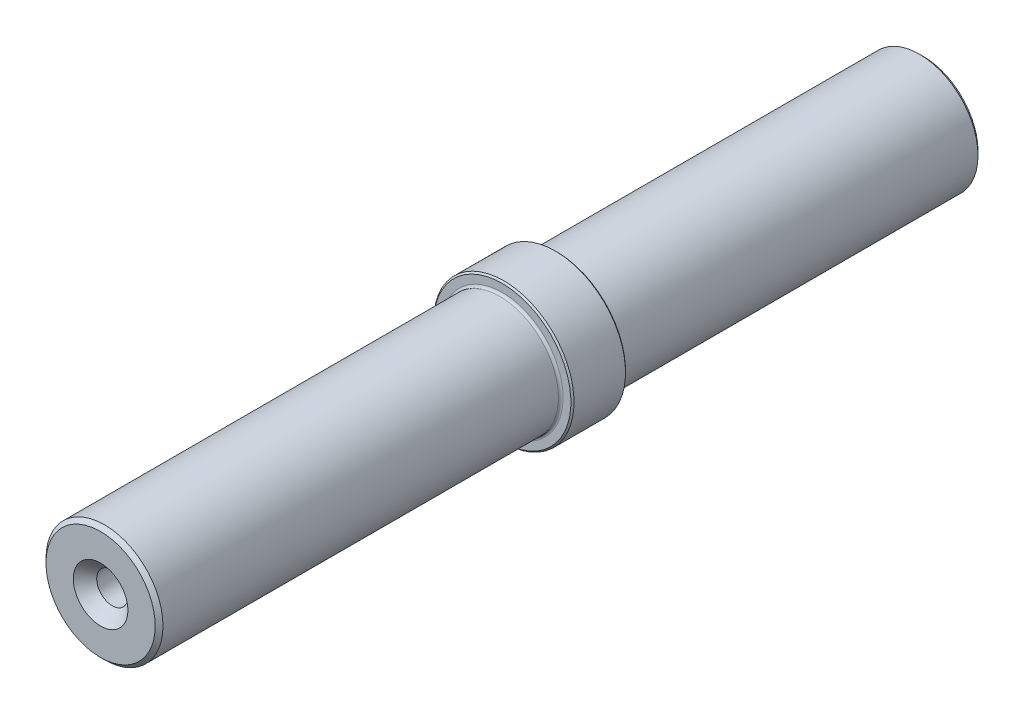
ISO-10303-21;
HEADER;
FILE_DESCRIPTION(('STEP AP214'),'2;1');
FILE_NAME('part.step','',(''),(''),'','','');
FILE_SCHEMA(('AUTOMOTIVE_DESIGN { 1 0 10303 214 1 1 1 1 }'));
ENDSEC;
DATA;
#1=APPLICATION_CONTEXT('core data for automotive mechanical design processes');
#2=APPLICATION_PROTOCOL_DEFINITION('international standard','automotive_design',2000,#1);
#3=PRODUCT_CONTEXT('',#1,'mechanical');
#4=PRODUCT('Part','Part','',(#3));
#5=PRODUCT_RELATED_PRODUCT_CATEGORY('part','',(#4));
#6=PRODUCT_DEFINITION_FORMATION('','',#4);
#7=PRODUCT_DEFINITION_CONTEXT('part definition',#1,'design');
#8=PRODUCT_DEFINITION('design','',#6,#7);
#9=PRODUCT_DEFINITION_SHAPE('','',#8);
#10=(LENGTH_UNIT() NAMED_UNIT(*) SI_UNIT(.MILLI.,.METRE.));
#11=(NAMED_UNIT(*) PLANE_ANGLE_UNIT() SI_UNIT($,.RADIAN.));
#12=(NAMED_UNIT(*) SI_UNIT($,.STERADIAN.) SOLID_ANGLE_UNIT());
#13=UNCERTAINTY_MEASURE_WITH_UNIT(LENGTH_MEASURE(1.E-05),#10,'distance_accuracy_value','');
#14=(GEOMETRIC_REPRESENTATION_CONTEXT(3) GLOBAL_UNCERTAINTY_ASSIGNED_CONTEXT((#13)) GLOBAL_UNIT_ASSIGNED_CONTEXT((#10,
#11,#12)) REPRESENTATION_CONTEXT('',''));
#15=CARTESIAN_POINT('',(0.,0.,0.));
#16=DIRECTION('',(0.,0.,1.));
#17=DIRECTION('',(1.,0.,0.));
#18=AXIS2_PLACEMENT_3D('',#15,#16,#17);
#19=CARTESIAN_POINT('',(0.,0.,105.5));
#20=DIRECTION('',(0.,0.,-1.));
#21=DIRECTION('',(-1.,0.,0.));
#22=AXIS2_PLACEMENT_3D('',#19,#20,#21);
#23=CYLINDRICAL_SURFACE('',#22,7.5);
#24=CARTESIAN_POINT('',(0.,0.,54.3));
#25=DIRECTION('',(0.,0.,-1.));
#26=DIRECTION('',(-1.,0.,0.));
#27=AXIS2_PLACEMENT_3D('',#24,#25,#26);
#28=CIRCLE('',#27,7.5);
#29=CARTESIAN_POINT('',(-7.5,0.,54.3));
#30=VERTEX_POINT('',#29);
#31=EDGE_CURVE('E112',#30,#30,#28,.F.);
#32=ORIENTED_EDGE('',*,*,#31,.T.);
#33=EDGE_LOOP('',(#32));
#34=FACE_BOUND('',#33,.T.);
#35=CARTESIAN_POINT('',(0.,0.,105.));
#36=DIRECTION('',(0.,0.,1.));
#37=DIRECTION('',(1.,0.,0.));
#38=AXIS2_PLACEMENT_3D('',#35,#36,#37);
#39=CIRCLE('',#38,7.5);
#40=CARTESIAN_POINT('',(7.5,0.,105.));
#41=VERTEX_POINT('',#40);
#42=EDGE_CURVE('E100',#41,#41,#39,.F.);
#43=ORIENTED_EDGE('',*,*,#42,.T.);
#44=EDGE_LOOP('',(#43));
#45=FACE_BOUND('',#44,.T.);
#46=ADVANCED_FACE('F57',(#34,#45),#23,.T.);
#47=CARTESIAN_POINT('',(0.,0.,105.5));
#48=DIRECTION('',(0.,0.,1.));
#49=DIRECTION('',(1.,0.,0.));
#50=AXIS2_PLACEMENT_3D('',#47,#48,#49);
#51=PLANE('',#50);
#52=CARTESIAN_POINT('',(0.,0.,105.5));
#53=DIRECTION('',(0.,0.,1.));
#54=DIRECTION('',(1.,0.,0.));
#55=AXIS2_PLACEMENT_3D('',#52,#53,#54);
#56=CIRCLE('',#55,6.99999999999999);
#57=CARTESIAN_POINT('',(6.99999999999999,0.,105.5));
#58=VERTEX_POINT('',#57);
#59=EDGE_CURVE('E97',#58,#58,#56,.T.);
#60=ORIENTED_EDGE('',*,*,#59,.T.);
#61=EDGE_LOOP('',(#60));
#62=FACE_BOUND('',#61,.T.);
#63=CARTESIAN_POINT('',(0.,0.,105.5));
#64=DIRECTION('',(0.,0.,1.));
#65=DIRECTION('',(1.,0.,0.));
#66=AXIS2_PLACEMENT_3D('',#63,#64,#65);
#67=CIRCLE('',#66,3.5);
#68=CARTESIAN_POINT('',(3.5,0.,105.5));
#69=VERTEX_POINT('',#68);
#70=EDGE_CURVE('E88',#69,#69,#67,.T.);
#71=ORIENTED_EDGE('',*,*,#70,.F.);
#72=EDGE_LOOP('',(#71));
#73=FACE_BOUND('',#72,.T.);
#74=ADVANCED_FACE('F175',(#62,#73),#51,.T.);
#75=CARTESIAN_POINT('',(0.,0.,54.));
#76=DIRECTION('',(0.,0.,-1.));
#77=DIRECTION('',(-1.,0.,0.));
#78=AXIS2_PLACEMENT_3D('',#75,#76,#77);
#79=CYLINDRICAL_SURFACE('',#78,9.);
#80=CARTESIAN_POINT('',(0.,0.,47.2));
#81=DIRECTION('',(0.,0.,-1.));
#82=DIRECTION('',(-1.,0.,0.));
#83=AXIS2_PLACEMENT_3D('',#80,#81,#82);
#84=CIRCLE('',#83,9.);
#85=CARTESIAN_POINT('',(-9.,0.,47.2));
#86=VERTEX_POINT('',#85);
#87=EDGE_CURVE('E65',#86,#86,#84,.F.);
#88=ORIENTED_EDGE('',*,*,#87,.T.);
#89=EDGE_LOOP('',(#88));
#90=FACE_BOUND('',#89,.T.);
#91=CARTESIAN_POINT('',(0.,0.,53.8));
#92=DIRECTION('',(0.,0.,-1.));
#93=DIRECTION('',(-1.,0.,0.));
#94=AXIS2_PLACEMENT_3D('',#91,#92,#93);
#95=CIRCLE('',#94,9.);
#96=CARTESIAN_POINT('',(-9.,0.,53.8));
#97=VERTEX_POINT('',#96);
#98=EDGE_CURVE('E124',#97,#97,#95,.T.);
#99=ORIENTED_EDGE('',*,*,#98,.T.);
#100=EDGE_LOOP('',(#99));
#101=FACE_BOUND('',#100,.T.);
#102=ADVANCED_FACE('F129',(#90,#101),#79,.T.);
#103=CARTESIAN_POINT('',(0.,0.,54.));
#104=DIRECTION('',(0.,0.,-1.));
#105=DIRECTION('',(-1.,0.,0.));
#106=AXIS2_PLACEMENT_3D('',#103,#104,#105);
#107=PLANE('',#106);
#108=CARTESIAN_POINT('',(0.,0.,54.));
#109=DIRECTION('',(0.,0.,-1.));
#110=DIRECTION('',(-1.,0.,0.));
#111=AXIS2_PLACEMENT_3D('',#108,#109,#110);
#112=CIRCLE('',#111,8.79999999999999);
#113=CARTESIAN_POINT('',(-8.79999999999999,0.,54.));
#114=VERTEX_POINT('',#113);
#115=EDGE_CURVE('E13',#114,#114,#112,.F.);
#116=ORIENTED_EDGE('',*,*,#115,.T.);
#117=EDGE_LOOP('',(#116));
#118=FACE_BOUND('',#117,.T.);
#119=CARTESIAN_POINT('',(0.,0.,54.));
#120=DIRECTION('',(0.,0.,-1.));
#121=DIRECTION('',(-1.,0.,0.));
#122=AXIS2_PLACEMENT_3D('',#119,#120,#121);
#123=CIRCLE('',#122,7.8);
#124=CARTESIAN_POINT('',(-7.8,0.,54.));
#125=VERTEX_POINT('',#124);
#126=EDGE_CURVE('E109',#125,#125,#123,.T.);
#127=ORIENTED_EDGE('',*,*,#126,.T.);
#128=EDGE_LOOP('',(#127));
#129=FACE_BOUND('',#128,.T.);
#130=ADVANCED_FACE('F142',(#118,#129),#107,.F.);
#131=CARTESIAN_POINT('',(0.,0.,47.));
#132=DIRECTION('',(0.,0.,-1.));
#133=DIRECTION('',(-1.,0.,0.));
#134=AXIS2_PLACEMENT_3D('',#131,#132,#133);
#135=PLANE('',#134);
#136=CARTESIAN_POINT('',(0.,0.,47.));
#137=DIRECTION('',(0.,0.,-1.));
#138=DIRECTION('',(-1.,0.,0.));
#139=AXIS2_PLACEMENT_3D('',#136,#137,#138);
#140=CIRCLE('',#139,8.8);
#141=CARTESIAN_POINT('',(-8.8,0.,47.));
#142=VERTEX_POINT('',#141);
#143=EDGE_CURVE('E121',#142,#142,#140,.T.);
#144=ORIENTED_EDGE('',*,*,#143,.T.);
#145=EDGE_LOOP('',(#144));
#146=FACE_BOUND('',#145,.T.);
#147=CARTESIAN_POINT('',(0.,0.,47.));
#148=DIRECTION('',(0.,0.,-1.));
#149=DIRECTION('',(-1.,0.,0.));
#150=AXIS2_PLACEMENT_3D('',#147,#148,#149);
#151=CIRCLE('',#150,7.8);
#152=CARTESIAN_POINT('',(-7.8,0.,47.));
#153=VERTEX_POINT('',#152);
#154=EDGE_CURVE('E118',#153,#153,#151,.F.);
#155=ORIENTED_EDGE('',*,*,#154,.T.);
#156=EDGE_LOOP('',(#155));
#157=FACE_BOUND('',#156,.T.);
#158=ADVANCED_FACE('F138',(#146,#157),#135,.T.);
#159=CARTESIAN_POINT('',(0.,0.,0.));
#160=DIRECTION('',(0.,0.,1.));
#161=DIRECTION('',(1.,0.,0.));
#162=AXIS2_PLACEMENT_3D('',#159,#160,#161);
#163=PLANE('',#162);
#164=CARTESIAN_POINT('',(0.,0.,0.));
#165=DIRECTION('',(0.,0.,1.));
#166=DIRECTION('',(1.,0.,0.));
#167=AXIS2_PLACEMENT_3D('',#164,#165,#166);
#168=CIRCLE('',#167,6.99999999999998);
#169=CARTESIAN_POINT('',(6.99999999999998,0.,0.));
#170=VERTEX_POINT('',#169);
#171=EDGE_CURVE('E106',#170,#170,#168,.F.);
#172=ORIENTED_EDGE('',*,*,#171,.T.);
#173=EDGE_LOOP('',(#172));
#174=FACE_BOUND('',#173,.T.);
#175=CARTESIAN_POINT('',(0.,0.,0.));
#176=DIRECTION('',(0.,0.,-1.));
#177=DIRECTION('',(-1.,0.,0.));
#178=AXIS2_PLACEMENT_3D('',#175,#176,#177);
#179=CIRCLE('',#178,2.525);
#180=CARTESIAN_POINT('',(-2.525,0.,0.));
#181=VERTEX_POINT('',#180);
#182=EDGE_CURVE('E81',#181,#181,#179,.T.);
#183=ORIENTED_EDGE('',*,*,#182,.F.);
#184=EDGE_LOOP('',(#183));
#185=FACE_BOUND('',#184,.T.);
#186=ADVANCED_FACE('F141',(#174,#185),#163,.F.);
#187=CARTESIAN_POINT('',(0.,0.,46.7));
#188=DIRECTION('',(0.,0.,-1.));
#189=DIRECTION('',(-1.,0.,0.));
#190=AXIS2_PLACEMENT_3D('',#187,#188,#189);
#191=CIRCLE('',#190,7.5);
#192=CARTESIAN_POINT('',(-7.5,0.,46.7));
#193=VERTEX_POINT('',#192);
#194=EDGE_CURVE('E115',#193,#193,#191,.T.);
#195=ORIENTED_EDGE('',*,*,#194,.T.);
#196=EDGE_LOOP('',(#195));
#197=FACE_BOUND('',#196,.T.);
#198=CARTESIAN_POINT('',(0.,0.,0.500000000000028));
#199=DIRECTION('',(0.,0.,1.));
#200=DIRECTION('',(1.,0.,0.));
#201=AXIS2_PLACEMENT_3D('',#198,#199,#200);
#202=CIRCLE('',#201,7.5);
#203=CARTESIAN_POINT('',(7.5,0.,0.500000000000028));
#204=VERTEX_POINT('',#203);
#205=EDGE_CURVE('E103',#204,#204,#202,.T.);
#206=ORIENTED_EDGE('',*,*,#205,.T.);
#207=EDGE_LOOP('',(#206));
#208=FACE_BOUND('',#207,.T.);
#209=ADVANCED_FACE('F152',(#197,#208),#23,.T.);
#210=CARTESIAN_POINT('',(0.,0.,12.4));
#211=DIRECTION('',(0.,0.,-1.));
#212=DIRECTION('',(-1.,0.,0.));
#213=AXIS2_PLACEMENT_3D('',#210,#211,#212);
#214=CONICAL_SURFACE('',#213,2.1,1.02974425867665);
#215=CARTESIAN_POINT('',(0.,0.,13.6618072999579));
#216=VERTEX_POINT('',#215);
#217=VERTEX_LOOP('',#216);
#218=FACE_BOUND('',#217,.T.);
#219=CARTESIAN_POINT('',(0.,0.,12.4));
#220=DIRECTION('',(0.,0.,-1.));
#221=DIRECTION('',(-1.,0.,0.));
#222=AXIS2_PLACEMENT_3D('',#219,#220,#221);
#223=CIRCLE('',#222,2.1);
#224=CARTESIAN_POINT('',(-2.1,0.,12.4));
#225=VERTEX_POINT('',#224);
#226=EDGE_CURVE('E94',#225,#225,#223,.T.);
#227=ORIENTED_EDGE('',*,*,#226,.T.);
#228=EDGE_LOOP('',(#227));
#229=FACE_BOUND('',#228,.T.);
#230=ADVANCED_FACE('F155',(#218,#229),#214,.F.);
#231=CARTESIAN_POINT('',(0.,0.,0.));
#232=DIRECTION('',(0.,0.,-1.));
#233=DIRECTION('',(-1.,0.,0.));
#234=AXIS2_PLACEMENT_3D('',#231,#232,#233);
#235=CYLINDRICAL_SURFACE('',#234,2.1);
#236=ORIENTED_EDGE('',*,*,#226,.F.);
#237=EDGE_LOOP('',(#236));
#238=FACE_BOUND('',#237,.T.);
#239=CARTESIAN_POINT('',(0.,0.,0.425));
#240=DIRECTION('',(0.,0.,-1.));
#241=DIRECTION('',(-1.,0.,0.));
#242=AXIS2_PLACEMENT_3D('',#239,#240,#241);
#243=CIRCLE('',#242,2.1);
#244=CARTESIAN_POINT('',(-2.1,0.,0.425));
#245=VERTEX_POINT('',#244);
#246=EDGE_CURVE('E85',#245,#245,#243,.T.);
#247=ORIENTED_EDGE('',*,*,#246,.T.);
#248=EDGE_LOOP('',(#247));
#249=FACE_BOUND('',#248,.T.);
#250=ADVANCED_FACE('F194',(#238,#249),#235,.F.);
#251=CARTESIAN_POINT('',(0.,0.,0.));
#252=DIRECTION('',(0.,0.,-1.));
#253=DIRECTION('',(-1.,0.,0.));
#254=AXIS2_PLACEMENT_3D('',#251,#252,#253);
#255=CONICAL_SURFACE('',#254,2.525,0.78539816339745);
#256=ORIENTED_EDGE('',*,*,#246,.F.);
#257=EDGE_LOOP('',(#256));
#258=FACE_BOUND('',#257,.T.);
#259=ORIENTED_EDGE('',*,*,#182,.T.);
#260=EDGE_LOOP('',(#259));
#261=FACE_BOUND('',#260,.T.);
#262=ADVANCED_FACE('F75',(#258,#261),#255,.F.);
#263=CARTESIAN_POINT('',(0.,0.,90.5));
#264=DIRECTION('',(0.,0.,1.));
#265=DIRECTION('',(1.,0.,0.));
#266=AXIS2_PLACEMENT_3D('',#263,#264,#265);
#267=CONICAL_SURFACE('',#266,2.,1.02974425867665);
#268=CARTESIAN_POINT('',(0.,0.,89.2982787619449));
#269=VERTEX_POINT('',#268);
#270=VERTEX_LOOP('',#269);
#271=FACE_BOUND('',#270,.T.);
#272=CARTESIAN_POINT('',(0.,0.,90.5));
#273=DIRECTION('',(0.,0.,1.));
#274=DIRECTION('',(1.,0.,0.));
#275=AXIS2_PLACEMENT_3D('',#272,#273,#274);
#276=CIRCLE('',#275,2.);
#277=CARTESIAN_POINT('',(2.,0.,90.5));
#278=VERTEX_POINT('',#277);
#279=EDGE_CURVE('E79',#278,#278,#276,.T.);
#280=ORIENTED_EDGE('',*,*,#279,.T.);
#281=EDGE_LOOP('',(#280));
#282=FACE_BOUND('',#281,.T.);
#283=ADVANCED_FACE('F71',(#271,#282),#267,.F.);
#284=CARTESIAN_POINT('',(0.,0.,105.5));
#285=DIRECTION('',(0.,0.,1.));
#286=DIRECTION('',(1.,0.,0.));
#287=AXIS2_PLACEMENT_3D('',#284,#285,#286);
#288=CYLINDRICAL_SURFACE('',#287,2.);
#289=ORIENTED_EDGE('',*,*,#279,.F.);
#290=EDGE_LOOP('',(#289));
#291=FACE_BOUND('',#290,.T.);
#292=CARTESIAN_POINT('',(0.,0.,104.));
#293=DIRECTION('',(0.,0.,1.));
#294=DIRECTION('',(1.,0.,0.));
#295=AXIS2_PLACEMENT_3D('',#292,#293,#294);
#296=CIRCLE('',#295,2.);
#297=CARTESIAN_POINT('',(2.,0.,104.));
#298=VERTEX_POINT('',#297);
#299=EDGE_CURVE('E82',#298,#298,#296,.T.);
#300=ORIENTED_EDGE('',*,*,#299,.T.);
#301=EDGE_LOOP('',(#300));
#302=FACE_BOUND('',#301,.T.);
#303=ADVANCED_FACE('F74',(#291,#302),#288,.F.);
#304=CARTESIAN_POINT('',(0.,0.,105.5));
#305=DIRECTION('',(0.,0.,1.));
#306=DIRECTION('',(1.,0.,0.));
#307=AXIS2_PLACEMENT_3D('',#304,#305,#306);
#308=CONICAL_SURFACE('',#307,3.5,0.785398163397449);
#309=ORIENTED_EDGE('',*,*,#299,.F.);
#310=EDGE_LOOP('',(#309));
#311=FACE_BOUND('',#310,.T.);
#312=ORIENTED_EDGE('',*,*,#70,.T.);
#313=EDGE_LOOP('',(#312));
#314=FACE_BOUND('',#313,.T.);
#315=ADVANCED_FACE('F170',(#311,#314),#308,.F.);
#316=CARTESIAN_POINT('',(0.,0.,105.5));
#317=DIRECTION('',(0.,0.,-1.));
#318=DIRECTION('',(-1.,0.,0.));
#319=AXIS2_PLACEMENT_3D('',#316,#317,#318);
#320=CONICAL_SURFACE('',#319,6.99999999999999,0.785398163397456);
#321=ORIENTED_EDGE('',*,*,#42,.F.);
#322=EDGE_LOOP('',(#321));
#323=FACE_BOUND('',#322,.T.);
#324=ORIENTED_EDGE('',*,*,#59,.F.);
#325=EDGE_LOOP('',(#324));
#326=FACE_BOUND('',#325,.T.);
#327=ADVANCED_FACE('F161',(#323,#326),#320,.T.);
#328=CARTESIAN_POINT('',(0.,0.,0.500000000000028));
#329=DIRECTION('',(0.,0.,1.));
#330=DIRECTION('',(1.,0.,0.));
#331=AXIS2_PLACEMENT_3D('',#328,#329,#330);
#332=CONICAL_SURFACE('',#331,7.5,0.785398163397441);
#333=ORIENTED_EDGE('',*,*,#171,.F.);
#334=EDGE_LOOP('',(#333));
#335=FACE_BOUND('',#334,.T.);
#336=ORIENTED_EDGE('',*,*,#205,.F.);
#337=EDGE_LOOP('',(#336));
#338=FACE_BOUND('',#337,.T.);
#339=ADVANCED_FACE('F159',(#335,#338),#332,.T.);
#340=CARTESIAN_POINT('',(0.,0.,54.3));
#341=DIRECTION('',(0.,0.,-1.));
#342=DIRECTION('',(-1.,0.,0.));
#343=AXIS2_PLACEMENT_3D('',#340,#341,#342);
#344=TOROIDAL_SURFACE('',#343,7.8,0.3);
#345=ORIENTED_EDGE('',*,*,#31,.F.);
#346=EDGE_LOOP('',(#345));
#347=FACE_BOUND('',#346,.T.);
#348=ORIENTED_EDGE('',*,*,#126,.F.);
#349=EDGE_LOOP('',(#348));
#350=FACE_BOUND('',#349,.T.);
#351=ADVANCED_FACE('F148',(#347,#350),#344,.F.);
#352=CARTESIAN_POINT('',(0.,0.,46.7));
#353=DIRECTION('',(0.,0.,-1.));
#354=DIRECTION('',(-1.,0.,0.));
#355=AXIS2_PLACEMENT_3D('',#352,#353,#354);
#356=TOROIDAL_SURFACE('',#355,7.8,0.3);
#357=ORIENTED_EDGE('',*,*,#154,.F.);
#358=EDGE_LOOP('',(#357));
#359=FACE_BOUND('',#358,.T.);
#360=ORIENTED_EDGE('',*,*,#194,.F.);
#361=EDGE_LOOP('',(#360));
#362=FACE_BOUND('',#361,.T.);
#363=ADVANCED_FACE('F135',(#359,#362),#356,.F.);
#364=CARTESIAN_POINT('',(0.,0.,47.));
#365=DIRECTION('',(0.,0.,1.));
#366=DIRECTION('',(1.,0.,0.));
#367=AXIS2_PLACEMENT_3D('',#364,#365,#366);
#368=CONICAL_SURFACE('',#367,8.8,0.785398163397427);
#369=ORIENTED_EDGE('',*,*,#87,.F.);
#370=EDGE_LOOP('',(#369));
#371=FACE_BOUND('',#370,.T.);
#372=ORIENTED_EDGE('',*,*,#143,.F.);
#373=EDGE_LOOP('',(#372));
#374=FACE_BOUND('',#373,.T.);
#375=ADVANCED_FACE('F132',(#371,#374),#368,.T.);
#376=CARTESIAN_POINT('',(0.,0.,53.8));
#377=DIRECTION('',(0.,0.,-1.));
#378=DIRECTION('',(-1.,0.,0.));
#379=AXIS2_PLACEMENT_3D('',#376,#377,#378);
#380=CONICAL_SURFACE('',#379,9.,0.785398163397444);
#381=ORIENTED_EDGE('',*,*,#115,.F.);
#382=EDGE_LOOP('',(#381));
#383=FACE_BOUND('',#382,.T.);
#384=ORIENTED_EDGE('',*,*,#98,.F.);
#385=EDGE_LOOP('',(#384));
#386=FACE_BOUND('',#385,.T.);
#387=ADVANCED_FACE('F59',(#383,#386),#380,.T.);
#388=CLOSED_SHELL('',(#46,#74,#102,#130,#158,#186,#209,#230,#250,#262,#283,#303,#315,#327,#339,
#351,#363,#375,#387));
#389=MANIFOLD_SOLID_BREP('B2',#388);
#390=ADVANCED_BREP_SHAPE_REPRESENTATION('',(#18,#389),#14);
#391=SHAPE_DEFINITION_REPRESENTATION(#9,#390);
ENDSEC;
END-ISO-10303-21;
